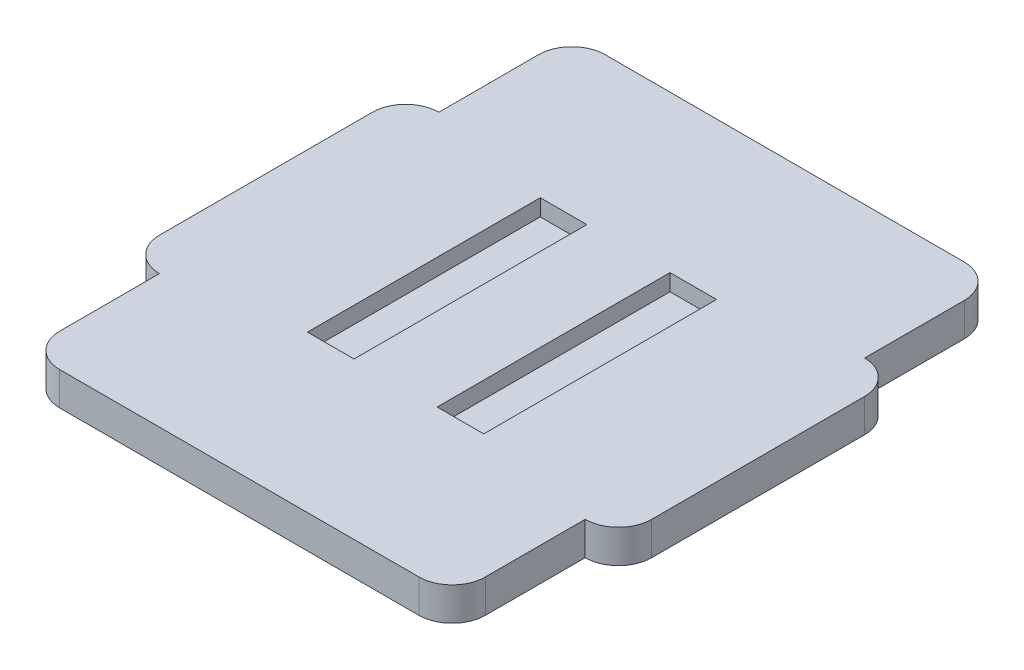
from build123d import *

# Parameters (mm, degrees)
SKETCH2_W           = 24
SKETCH2_H           = 42
SKETCH2_W_2         = 7
SKETCH2_H_2         = 3.5
SKETCH2_W_3         = 2
BOSS_EXTRUDE1_DEPTH = 5
SKETCH2_3_W         = 7
SKETCH2_3_H         = 35
BOSS_EXTRUDE2_DEPTH = 5
SKETCH3_W           = 7
SKETCH3_H           = 35
CUT_EXTRUDE1_DEPTH  = 2.5


with BuildPart() as part:
    # Sketch2 → Boss-Extrude1 (new body)
    with BuildSketch(Plane(origin=(0, 0, 0), x_dir=(1, 0, 0), z_dir=(0, 1, 0))):
        with Locations((14, 21)):
            Rectangle(SKETCH2_W, SKETCH2_H)
        Polygon((26, 42), (26, 0), (28, 0), (28, 3.5), (28, 38.5), (28, 42), align=None)
        with Locations((31.5, 1.75)):
            Rectangle(SKETCH2_W_2, SKETCH2_H_2)
        with BuildLine():
            Line((37, 42), (37, 0))
            Line((37, 0), (46, 0))
            ThreePointArc((46, 0), (49.535533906, 1.464466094), (51, 5))
            Line((51, 5), (51, 37))
            ThreePointArc((51, 37), (49.535533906, 40.535533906), (46, 42))
            Line((46, 42), (37, 42))
        make_face()
        with Locations((36, 21)):
            Rectangle(SKETCH2_W_3, SKETCH2_H)
        with Locations((31.5, 40.25)):
            Rectangle(SKETCH2_W_2, SKETCH2_H_2)
        with BuildLine():
            ThreePointArc((-23, 37), (-21.535533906, 40.535533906), (-18, 42))
            Line((-18, 42), (-9, 42))
            Line((-9, 42), (-9, 0))
            Line((-9, 0), (-18, 0))
            ThreePointArc((-18, 0), (-21.535533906, 1.464466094), (-23, 5))
            Line((-23, 5), (-23, 37))
        make_face()
        with Locations((-3.5, 1.75)):
            Rectangle(SKETCH2_W_2, SKETCH2_H_2)
        Polygon((-9, 42), (-9, 0), (-7, 0), (-7, 3.5), (-7, 38.5), (-7, 42), align=None)
        Polygon((0, 3.5), (0, 0), (2, 0), (2, 42), (0, 42), (0, 38.5), align=None)
        with Locations((-3.5, 40.25)):
            Rectangle(SKETCH2_W_2, SKETCH2_H_2)
        with BuildLine():
            Line((-13, -20), (41, -20))
            ThreePointArc((41, -20), (44.535533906, -18.535533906), (46, -15))
            Line((46, -15), (46, 0))
            Line((46, 0), (37, 0))
            Line((37, 0), (35, 0))
            Line((35, 0), (28, 0))
            Line((28, 0), (0, 0))
            Line((0, 0), (-7, 0))
            Line((-7, 0), (-9, 0))
            Line((-9, 0), (-18, 0))
            Line((-18, 0), (-18, -15))
            ThreePointArc((-18, -15), (-16.535533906, -18.535533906), (-13, -20))
        make_face()
        with BuildLine():
            Line((-13, 62), (41, 62))
            ThreePointArc((41, 62), (44.535533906, 60.535533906), (46, 57))
            Line((46, 57), (46, 42))
            Line((46, 42), (37, 42))
            Line((37, 42), (35, 42))
            Line((35, 42), (28, 42))
            Line((28, 42), (0, 42))
            Line((0, 42), (-7, 42))
            Line((-7, 42), (-9, 42))
            Line((-9, 42), (-18, 42))
            Line((-18, 42), (-18, 57))
            ThreePointArc((-18, 57), (-16.535533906, 60.535533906), (-13, 62))
        make_face()
    extrude(amount=BOSS_EXTRUDE1_DEPTH)

    # Sketch2_3 → Boss-Extrude2 (add)
    with BuildSketch(Plane(origin=(0, 0, 0), x_dir=(1, 0, 0), z_dir=(0, 1, 0))):
        with Locations((-3.5, 21)):
            Rectangle(SKETCH2_3_W, SKETCH2_3_H)
        with Locations((31.5, 21)):
            Rectangle(SKETCH2_3_W, SKETCH2_3_H)
    extrude(amount=BOSS_EXTRUDE2_DEPTH)

    # Sketch3 → Cut-Extrude1 (cut)
    with BuildSketch(Plane(origin=(0, 5, 0), x_dir=(1, 0, 0), z_dir=(0, 1, 0))):
        with Locations((23.75, 21)):
            Rectangle(SKETCH3_W, SKETCH3_H)
        with Locations((4.25, 21)):
            Rectangle(SKETCH3_W, SKETCH3_H)
    extrude(amount=-CUT_EXTRUDE1_DEPTH, mode=Mode.SUBTRACT)


solid = part.part
